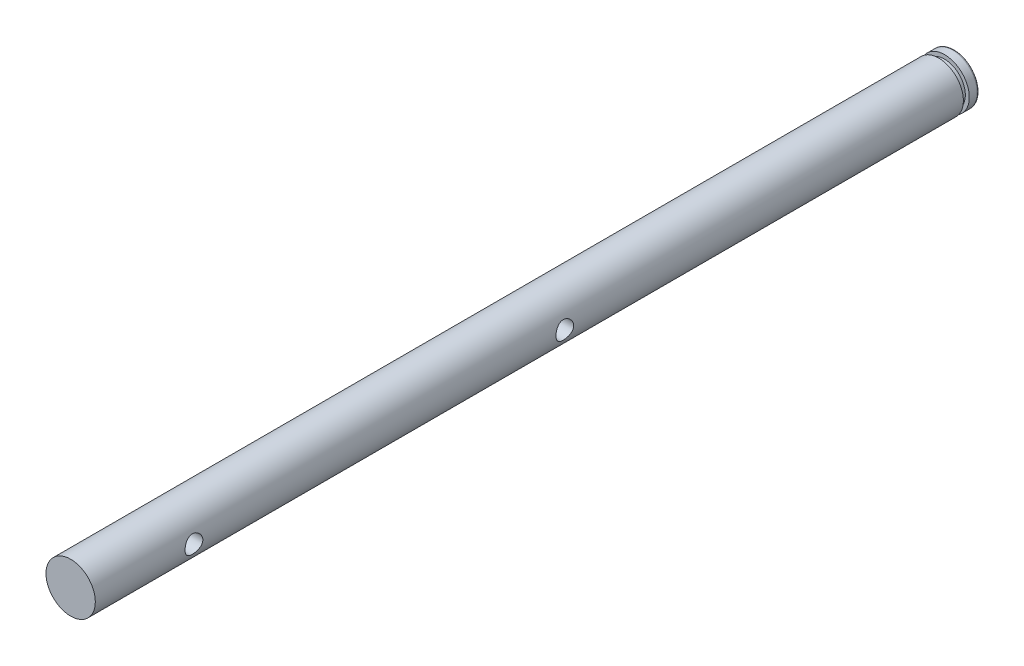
ISO-10303-21;
HEADER;
FILE_DESCRIPTION(('STEP AP214'),'2;1');
FILE_NAME('part.step','',(''),(''),'','','');
FILE_SCHEMA(('AUTOMOTIVE_DESIGN { 1 0 10303 214 1 1 1 1 }'));
ENDSEC;
DATA;
#1=APPLICATION_CONTEXT('core data for automotive mechanical design processes');
#2=APPLICATION_PROTOCOL_DEFINITION('international standard','automotive_design',2000,#1);
#3=PRODUCT_CONTEXT('',#1,'mechanical');
#4=PRODUCT('Part','Part','',(#3));
#5=PRODUCT_RELATED_PRODUCT_CATEGORY('part','',(#4));
#6=PRODUCT_DEFINITION_FORMATION('','',#4);
#7=PRODUCT_DEFINITION_CONTEXT('part definition',#1,'design');
#8=PRODUCT_DEFINITION('design','',#6,#7);
#9=PRODUCT_DEFINITION_SHAPE('','',#8);
#10=(LENGTH_UNIT() NAMED_UNIT(*) SI_UNIT(.MILLI.,.METRE.));
#11=(NAMED_UNIT(*) PLANE_ANGLE_UNIT() SI_UNIT($,.RADIAN.));
#12=(NAMED_UNIT(*) SI_UNIT($,.STERADIAN.) SOLID_ANGLE_UNIT());
#13=UNCERTAINTY_MEASURE_WITH_UNIT(LENGTH_MEASURE(1.E-05),#10,'distance_accuracy_value','');
#14=(GEOMETRIC_REPRESENTATION_CONTEXT(3) GLOBAL_UNCERTAINTY_ASSIGNED_CONTEXT((#13)) GLOBAL_UNIT_ASSIGNED_CONTEXT((#10,
#11,#12)) REPRESENTATION_CONTEXT('',''));
#15=CARTESIAN_POINT('',(0.,0.,0.));
#16=DIRECTION('',(0.,0.,1.));
#17=DIRECTION('',(1.,0.,0.));
#18=AXIS2_PLACEMENT_3D('',#15,#16,#17);
#19=CARTESIAN_POINT('',(0.,0.,113.792));
#20=DIRECTION('',(0.,0.,-1.));
#21=DIRECTION('',(-1.,0.,0.));
#22=AXIS2_PLACEMENT_3D('',#19,#20,#21);
#23=CYLINDRICAL_SURFACE('',#22,3.175);
#24=CARTESIAN_POINT('',(0.,0.,2.032));
#25=DIRECTION('',(0.,0.,-1.));
#26=DIRECTION('',(-1.,0.,0.));
#27=AXIS2_PLACEMENT_3D('',#24,#25,#26);
#28=CIRCLE('',#27,3.175);
#29=CARTESIAN_POINT('',(-3.175,0.,2.032));
#30=VERTEX_POINT('',#29);
#31=EDGE_CURVE('E123',#30,#30,#28,.T.);
#32=ORIENTED_EDGE('',*,*,#31,.F.);
#33=EDGE_LOOP('',(#32));
#34=FACE_BOUND('',#33,.T.);
#35=CARTESIAN_POINT('',(0.,0.,113.792));
#36=DIRECTION('',(0.,0.,1.));
#37=DIRECTION('',(1.,0.,0.));
#38=AXIS2_PLACEMENT_3D('',#35,#36,#37);
#39=CIRCLE('',#38,3.175);
#40=CARTESIAN_POINT('',(3.175,0.,113.792));
#41=VERTEX_POINT('',#40);
#42=EDGE_CURVE('E103',#41,#41,#39,.T.);
#43=ORIENTED_EDGE('',*,*,#42,.F.);
#44=EDGE_LOOP('',(#43));
#45=FACE_BOUND('',#44,.T.);
#46=CARTESIAN_POINT('',(3.175,0.,52.197));
#47=CARTESIAN_POINT('',(3.17500103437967,-0.0620737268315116,52.196998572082));
#48=CARTESIAN_POINT('',(3.17316341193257,-0.124137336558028,52.2020726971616));
#49=CARTESIAN_POINT('',(3.16601537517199,-0.246419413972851,52.222160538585));
#50=CARTESIAN_POINT('',(3.16070515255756,-0.306637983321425,52.2371737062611));
#51=CARTESIAN_POINT('',(3.14718455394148,-0.423449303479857,52.2765464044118));
#52=CARTESIAN_POINT('',(3.1389795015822,-0.480048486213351,52.3008887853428));
#53=CARTESIAN_POINT('',(3.12049390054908,-0.588358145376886,52.3581452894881));
#54=CARTESIAN_POINT('',(3.11021284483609,-0.64006742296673,52.3910615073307));
#55=CARTESIAN_POINT('',(3.08818914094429,-0.739177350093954,52.4658958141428));
#56=CARTESIAN_POINT('',(3.07640741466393,-0.786358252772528,52.5080933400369));
#57=CARTESIAN_POINT('',(3.05291072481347,-0.873147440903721,52.5996990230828));
#58=CARTESIAN_POINT('',(3.04119578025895,-0.912753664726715,52.6491091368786));
#59=CARTESIAN_POINT('',(3.01871377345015,-0.984612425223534,52.7558212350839));
#60=CARTESIAN_POINT('',(3.00799340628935,-1.0165638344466,52.8133368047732));
#61=CARTESIAN_POINT('',(2.98931724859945,-1.07024351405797,52.9333727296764));
#62=CARTESIAN_POINT('',(2.9813604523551,-1.09197550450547,52.9958912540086));
#63=CARTESIAN_POINT('',(2.96952774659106,-1.12374781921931,53.1216386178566));
#64=CARTESIAN_POINT('',(2.96550691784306,-1.13420490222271,53.1847480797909));
#65=CARTESIAN_POINT('',(2.96157547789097,-1.14443378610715,53.3119441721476));
#66=CARTESIAN_POINT('',(2.96166333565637,-1.14420956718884,53.3760304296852));
#67=CARTESIAN_POINT('',(2.96581362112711,-1.13340268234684,53.4996482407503));
#68=CARTESIAN_POINT('',(2.96965932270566,-1.12338482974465,53.55923776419));
#69=CARTESIAN_POINT('',(2.98053386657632,-1.09420418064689,53.6758252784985));
#70=CARTESIAN_POINT('',(2.98756315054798,-1.07504011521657,53.7328229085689));
#71=CARTESIAN_POINT('',(3.00415202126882,-1.02777926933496,53.8438084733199));
#72=CARTESIAN_POINT('',(3.01375474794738,-0.999528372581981,53.8977240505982));
#73=CARTESIAN_POINT('',(3.0343927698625,-0.935002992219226,54.0002186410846));
#74=CARTESIAN_POINT('',(3.04542853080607,-0.89872589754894,54.0487959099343));
#75=CARTESIAN_POINT('',(3.0685184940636,-0.816546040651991,54.1423797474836));
#76=CARTESIAN_POINT('',(3.08059357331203,-0.770188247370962,54.1869825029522));
#77=CARTESIAN_POINT('',(3.10381389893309,-0.67050749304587,54.2678954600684));
#78=CARTESIAN_POINT('',(3.11495902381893,-0.617183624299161,54.3042045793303));
#79=CARTESIAN_POINT('',(3.13525535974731,-0.504119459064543,54.3678988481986));
#80=CARTESIAN_POINT('',(3.14437819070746,-0.444303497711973,54.395159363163));
#81=CARTESIAN_POINT('',(3.15939343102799,-0.320525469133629,54.4390998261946));
#82=CARTESIAN_POINT('',(3.16528715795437,-0.256565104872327,54.4557840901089));
#83=CARTESIAN_POINT('',(3.17295346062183,-0.12971995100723,54.4773449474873));
#84=CARTESIAN_POINT('',(3.17491588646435,-0.0669390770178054,54.4827659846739));
#85=CARTESIAN_POINT('',(3.17507871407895,0.0586581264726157,54.4832190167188));
#86=CARTESIAN_POINT('',(3.17327987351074,0.121474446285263,54.4782531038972));
#87=CARTESIAN_POINT('',(3.16624774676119,0.243071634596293,54.4584938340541));
#88=CARTESIAN_POINT('',(3.16113624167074,0.301916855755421,54.4440487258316));
#89=CARTESIAN_POINT('',(3.14811445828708,0.416314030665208,54.4061909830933));
#90=CARTESIAN_POINT('',(3.14020381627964,0.471865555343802,54.3827771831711));
#91=CARTESIAN_POINT('',(3.12209356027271,0.579863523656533,54.3269185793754));
#92=CARTESIAN_POINT('',(3.11183529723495,0.632176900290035,54.2942360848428));
#93=CARTESIAN_POINT('',(3.09017588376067,0.730745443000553,54.2210401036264));
#94=CARTESIAN_POINT('',(3.07877433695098,0.776998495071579,54.1805238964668));
#95=CARTESIAN_POINT('',(3.05533502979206,0.864710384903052,54.0902616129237));
#96=CARTESIAN_POINT('',(3.04329578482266,0.905781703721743,54.0401383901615));
#97=CARTESIAN_POINT('',(3.02054065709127,0.978996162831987,53.9334644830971));
#98=CARTESIAN_POINT('',(3.00982484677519,1.01113881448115,53.8769134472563));
#99=CARTESIAN_POINT('',(2.99100147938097,1.06553723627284,53.7587081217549));
#100=CARTESIAN_POINT('',(2.98289789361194,1.08777797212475,53.6970462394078));
#101=CARTESIAN_POINT('',(2.97041175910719,1.12143097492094,53.5704840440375));
#102=CARTESIAN_POINT('',(2.96602715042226,1.13284923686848,53.5055855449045));
#103=CARTESIAN_POINT('',(2.96173482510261,1.14402104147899,53.3785536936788));
#104=CARTESIAN_POINT('',(2.96157606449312,1.14442871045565,53.3164858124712));
#105=CARTESIAN_POINT('',(2.96511823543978,1.13521921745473,53.1932164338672));
#106=CARTESIAN_POINT('',(2.96881885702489,1.12560286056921,53.1320148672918));
#107=CARTESIAN_POINT('',(2.97946165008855,1.09711156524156,53.0138138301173));
#108=CARTESIAN_POINT('',(2.98631739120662,1.07848285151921,52.956746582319));
#109=CARTESIAN_POINT('',(3.00245409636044,1.0327054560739,52.846509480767));
#110=CARTESIAN_POINT('',(3.01173564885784,1.00555470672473,52.7933405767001));
#111=CARTESIAN_POINT('',(3.03224829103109,0.941946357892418,52.6895611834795));
#112=CARTESIAN_POINT('',(3.04355296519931,0.905095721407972,52.6392062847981));
#113=CARTESIAN_POINT('',(3.06656563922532,0.82376246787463,52.5451850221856));
#114=CARTESIAN_POINT('',(3.07827376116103,0.779277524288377,52.5015207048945));
#115=CARTESIAN_POINT('',(3.10145286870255,0.681367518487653,52.4199796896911));
#116=CARTESIAN_POINT('',(3.11288513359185,0.627614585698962,52.3824840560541));
#117=CARTESIAN_POINT('',(3.13361916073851,0.514175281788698,52.3170836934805));
#118=CARTESIAN_POINT('',(3.14292103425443,0.454489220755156,52.289178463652));
#119=CARTESIAN_POINT('',(3.15841103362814,0.330185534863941,52.243711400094));
#120=CARTESIAN_POINT('',(3.16456606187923,0.265523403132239,52.2262591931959));
#121=CARTESIAN_POINT('',(3.17285917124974,0.133902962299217,52.2029066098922));
#122=CARTESIAN_POINT('',(3.17499888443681,0.0669455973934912,52.1970015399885));
#123=CARTESIAN_POINT('',(3.175,0.,52.197));
#124=B_SPLINE_CURVE_WITH_KNOTS('',3,(#46,#47,#48,#49,#50,#51,#52,#53,#54,#55,#56,#57,#58,#59,
#60,#61,#62,#63,#64,#65,#66,#67,#68,#69,#70,#71,#72,#73,#74,#75,#76,#77,#78,#79,#80,#81,#82,#83,
#84,#85,#86,#87,#88,#89,#90,#91,#92,#93,#94,#95,#96,#97,#98,#99,#100,#101,#102,#103,#104,#105,
#106,#107,#108,#109,#110,#111,#112,#113,#114,#115,#116,#117,#118,#119,#120,#121,#122,#123),
.UNSPECIFIED.,.T.,.F.,(4,2,2,2,2,2,2,2,2,2,2,2,2,2,2,2,2,2,2,2,2,2,2,2,2,2,2,2,2,2,2,2,2,2,2,2,
2,2,4),(0.,0.185974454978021,0.371938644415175,0.557562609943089,0.743231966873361,
0.935530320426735,1.12788093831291,1.3268730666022,1.52579270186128,1.71707692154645,
1.90828986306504,2.08908884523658,2.26991291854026,2.45398166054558,2.63811037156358,
2.83357232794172,3.02905977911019,3.22713778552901,3.42513491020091,3.61331470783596,
3.801456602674,3.98304672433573,4.16466045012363,4.35143424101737,4.53827301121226,
4.73508157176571,4.93190090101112,5.12901805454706,5.32602595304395,5.51130234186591,
5.69656385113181,5.87702752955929,6.05753502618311,6.24694695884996,6.43641671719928,
6.63503139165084,6.83363569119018,7.03428796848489,7.2348586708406),.UNSPECIFIED.);
#125=CARTESIAN_POINT('',(3.175,0.,52.197));
#126=VERTEX_POINT('',#125);
#127=EDGE_CURVE('E86',#126,#126,#124,.T.);
#128=ORIENTED_EDGE('',*,*,#127,.T.);
#129=EDGE_LOOP('',(#128));
#130=FACE_BOUND('',#129,.T.);
#131=CARTESIAN_POINT('',(-3.175,0.,54.483));
#132=CARTESIAN_POINT('',(-3.17500103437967,-0.062073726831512,54.483001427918));
#133=CARTESIAN_POINT('',(-3.17316341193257,-0.124137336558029,54.4779273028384));
#134=CARTESIAN_POINT('',(-3.16601537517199,-0.246419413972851,54.457839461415));
#135=CARTESIAN_POINT('',(-3.16070515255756,-0.306637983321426,54.4428262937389));
#136=CARTESIAN_POINT('',(-3.14718455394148,-0.423449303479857,54.4034535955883));
#137=CARTESIAN_POINT('',(-3.1389795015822,-0.480048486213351,54.3791112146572));
#138=CARTESIAN_POINT('',(-3.12049390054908,-0.588358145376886,54.3218547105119));
#139=CARTESIAN_POINT('',(-3.11021284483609,-0.64006742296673,54.2889384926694));
#140=CARTESIAN_POINT('',(-3.08818914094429,-0.739177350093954,54.2141041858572));
#141=CARTESIAN_POINT('',(-3.07640741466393,-0.786358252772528,54.1719066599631));
#142=CARTESIAN_POINT('',(-3.05291072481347,-0.873147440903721,54.0803009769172));
#143=CARTESIAN_POINT('',(-3.04119578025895,-0.912753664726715,54.0308908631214));
#144=CARTESIAN_POINT('',(-3.01871377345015,-0.984612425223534,53.9241787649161));
#145=CARTESIAN_POINT('',(-3.00799340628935,-1.0165638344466,53.8666631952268));
#146=CARTESIAN_POINT('',(-2.98931724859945,-1.07024351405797,53.7466272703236));
#147=CARTESIAN_POINT('',(-2.9813604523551,-1.09197550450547,53.6841087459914));
#148=CARTESIAN_POINT('',(-2.96952774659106,-1.12374781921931,53.5583613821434));
#149=CARTESIAN_POINT('',(-2.96550691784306,-1.13420490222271,53.4952519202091));
#150=CARTESIAN_POINT('',(-2.96157547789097,-1.14443378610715,53.3680558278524));
#151=CARTESIAN_POINT('',(-2.96166333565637,-1.14420956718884,53.3039695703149));
#152=CARTESIAN_POINT('',(-2.96581362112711,-1.13340268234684,53.1803517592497));
#153=CARTESIAN_POINT('',(-2.96965932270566,-1.12338482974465,53.1207622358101));
#154=CARTESIAN_POINT('',(-2.98053386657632,-1.0942041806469,53.0041747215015));
#155=CARTESIAN_POINT('',(-2.98756315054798,-1.07504011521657,52.9471770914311));
#156=CARTESIAN_POINT('',(-3.00415202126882,-1.02777926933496,52.8361915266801));
#157=CARTESIAN_POINT('',(-3.01375474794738,-0.999528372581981,52.7822759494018));
#158=CARTESIAN_POINT('',(-3.0343927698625,-0.935002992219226,52.6797813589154));
#159=CARTESIAN_POINT('',(-3.04542853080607,-0.89872589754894,52.6312040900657));
#160=CARTESIAN_POINT('',(-3.0685184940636,-0.816546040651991,52.5376202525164));
#161=CARTESIAN_POINT('',(-3.08059357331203,-0.770188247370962,52.4930174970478));
#162=CARTESIAN_POINT('',(-3.10381389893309,-0.67050749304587,52.4121045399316));
#163=CARTESIAN_POINT('',(-3.11495902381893,-0.617183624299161,52.3757954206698));
#164=CARTESIAN_POINT('',(-3.13525535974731,-0.504119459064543,52.3121011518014));
#165=CARTESIAN_POINT('',(-3.14437819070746,-0.444303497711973,52.284840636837));
#166=CARTESIAN_POINT('',(-3.15939343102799,-0.320525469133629,52.2409001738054));
#167=CARTESIAN_POINT('',(-3.16528715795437,-0.256565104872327,52.2242159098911));
#168=CARTESIAN_POINT('',(-3.17295346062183,-0.12971995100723,52.2026550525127));
#169=CARTESIAN_POINT('',(-3.17491588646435,-0.0669390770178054,52.1972340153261));
#170=CARTESIAN_POINT('',(-3.17507871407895,0.0586581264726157,52.1967809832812));
#171=CARTESIAN_POINT('',(-3.17327987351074,0.121474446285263,52.2017468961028));
#172=CARTESIAN_POINT('',(-3.16624774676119,0.243071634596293,52.2215061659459));
#173=CARTESIAN_POINT('',(-3.16113624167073,0.301916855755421,52.2359512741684));
#174=CARTESIAN_POINT('',(-3.14811445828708,0.416314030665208,52.2738090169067));
#175=CARTESIAN_POINT('',(-3.14020381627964,0.471865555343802,52.2972228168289));
#176=CARTESIAN_POINT('',(-3.12209356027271,0.579863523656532,52.3530814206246));
#177=CARTESIAN_POINT('',(-3.11183529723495,0.632176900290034,52.3857639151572));
#178=CARTESIAN_POINT('',(-3.09017588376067,0.730745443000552,52.4589598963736));
#179=CARTESIAN_POINT('',(-3.07877433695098,0.776998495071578,52.4994761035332));
#180=CARTESIAN_POINT('',(-3.05533502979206,0.864710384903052,52.5897383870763));
#181=CARTESIAN_POINT('',(-3.04329578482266,0.905781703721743,52.6398616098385));
#182=CARTESIAN_POINT('',(-3.02054065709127,0.978996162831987,52.7465355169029));
#183=CARTESIAN_POINT('',(-3.00982484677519,1.01113881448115,52.8030865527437));
#184=CARTESIAN_POINT('',(-2.99100147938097,1.06553723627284,52.9212918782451));
#185=CARTESIAN_POINT('',(-2.98289789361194,1.08777797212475,52.9829537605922));
#186=CARTESIAN_POINT('',(-2.97041175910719,1.12143097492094,53.1095159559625));
#187=CARTESIAN_POINT('',(-2.96602715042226,1.13284923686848,53.1744144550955));
#188=CARTESIAN_POINT('',(-2.96173482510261,1.14402104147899,53.3014463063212));
#189=CARTESIAN_POINT('',(-2.96157606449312,1.14442871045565,53.3635141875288));
#190=CARTESIAN_POINT('',(-2.96511823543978,1.13521921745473,53.4867835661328));
#191=CARTESIAN_POINT('',(-2.96881885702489,1.12560286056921,53.5479851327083));
#192=CARTESIAN_POINT('',(-2.97946165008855,1.09711156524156,53.6661861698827));
#193=CARTESIAN_POINT('',(-2.98631739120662,1.07848285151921,53.7232534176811));
#194=CARTESIAN_POINT('',(-3.00245409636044,1.0327054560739,53.833490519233));
#195=CARTESIAN_POINT('',(-3.01173564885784,1.00555470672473,53.8866594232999));
#196=CARTESIAN_POINT('',(-3.03224829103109,0.941946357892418,53.9904388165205));
#197=CARTESIAN_POINT('',(-3.04355296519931,0.905095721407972,54.0407937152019));
#198=CARTESIAN_POINT('',(-3.06656563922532,0.82376246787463,54.1348149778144));
#199=CARTESIAN_POINT('',(-3.07827376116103,0.779277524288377,54.1784792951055));
#200=CARTESIAN_POINT('',(-3.10145286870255,0.681367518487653,54.2600203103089));
#201=CARTESIAN_POINT('',(-3.11288513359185,0.627614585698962,54.2975159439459));
#202=CARTESIAN_POINT('',(-3.13361916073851,0.514175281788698,54.3629163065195));
#203=CARTESIAN_POINT('',(-3.14292103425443,0.454489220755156,54.3908215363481));
#204=CARTESIAN_POINT('',(-3.15841103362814,0.330185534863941,54.436288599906));
#205=CARTESIAN_POINT('',(-3.16456606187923,0.265523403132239,54.4537408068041));
#206=CARTESIAN_POINT('',(-3.17285917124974,0.133902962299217,54.4770933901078));
#207=CARTESIAN_POINT('',(-3.17499888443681,0.0669455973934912,54.4829984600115));
#208=CARTESIAN_POINT('',(-3.175,0.,54.483));
#209=B_SPLINE_CURVE_WITH_KNOTS('',3,(#131,#132,#133,#134,#135,#136,#137,#138,#139,#140,#141,
#142,#143,#144,#145,#146,#147,#148,#149,#150,#151,#152,#153,#154,#155,#156,#157,#158,#159,#160,
#161,#162,#163,#164,#165,#166,#167,#168,#169,#170,#171,#172,#173,#174,#175,#176,#177,#178,#179,
#180,#181,#182,#183,#184,#185,#186,#187,#188,#189,#190,#191,#192,#193,#194,#195,#196,#197,#198,
#199,#200,#201,#202,#203,#204,#205,#206,#207,#208),.UNSPECIFIED.,.T.,.F.,(4,2,2,2,2,2,2,2,2,2,2,
2,2,2,2,2,2,2,2,2,2,2,2,2,2,2,2,2,2,2,2,2,2,2,2,2,2,2,4),(0.,0.185974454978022,
0.371938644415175,0.557562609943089,0.743231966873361,0.935530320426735,1.12788093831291,
1.3268730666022,1.52579270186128,1.71707692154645,1.90828986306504,2.08908884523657,
2.26991291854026,2.45398166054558,2.63811037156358,2.83357232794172,3.02905977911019,
3.22713778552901,3.42513491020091,3.61331470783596,3.801456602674,3.98304672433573,
4.16466045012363,4.35143424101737,4.53827301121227,4.73508157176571,4.93190090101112,
5.12901805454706,5.32602595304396,5.51130234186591,5.69656385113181,5.87702752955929,
6.05753502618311,6.24694695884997,6.43641671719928,6.63503139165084,6.83363569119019,
7.03428796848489,7.2348586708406),.UNSPECIFIED.);
#210=CARTESIAN_POINT('',(-3.175,0.,54.483));
#211=VERTEX_POINT('',#210);
#212=EDGE_CURVE('E91',#211,#211,#209,.T.);
#213=ORIENTED_EDGE('',*,*,#212,.T.);
#214=EDGE_LOOP('',(#213));
#215=FACE_BOUND('',#214,.T.);
#216=CARTESIAN_POINT('',(3.175,0.,99.949));
#217=CARTESIAN_POINT('',(3.17500103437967,-0.0620737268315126,99.948998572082));
#218=CARTESIAN_POINT('',(3.17316341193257,-0.12413733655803,99.9540726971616));
#219=CARTESIAN_POINT('',(3.16601537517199,-0.246419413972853,99.974160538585));
#220=CARTESIAN_POINT('',(3.16070515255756,-0.306637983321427,99.9891737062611));
#221=CARTESIAN_POINT('',(3.14718455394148,-0.42344930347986,100.028546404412));
#222=CARTESIAN_POINT('',(3.1389795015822,-0.480048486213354,100.052888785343));
#223=CARTESIAN_POINT('',(3.12049390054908,-0.588358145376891,100.110145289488));
#224=CARTESIAN_POINT('',(3.11021284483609,-0.640067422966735,100.143061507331));
#225=CARTESIAN_POINT('',(3.08818914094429,-0.739177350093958,100.217895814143));
#226=CARTESIAN_POINT('',(3.07640741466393,-0.786358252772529,100.260093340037));
#227=CARTESIAN_POINT('',(3.05291072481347,-0.87314744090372,100.351699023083));
#228=CARTESIAN_POINT('',(3.04119578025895,-0.912753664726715,100.401109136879));
#229=CARTESIAN_POINT('',(3.01871377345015,-0.984612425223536,100.507821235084));
#230=CARTESIAN_POINT('',(3.00799340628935,-1.01656383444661,100.565336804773));
#231=CARTESIAN_POINT('',(2.98931724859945,-1.07024351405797,100.685372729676));
#232=CARTESIAN_POINT('',(2.9813604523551,-1.09197550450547,100.747891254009));
#233=CARTESIAN_POINT('',(2.96952774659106,-1.12374781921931,100.873638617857));
#234=CARTESIAN_POINT('',(2.96550691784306,-1.13420490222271,100.936748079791));
#235=CARTESIAN_POINT('',(2.96157547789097,-1.14443378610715,101.063944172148));
#236=CARTESIAN_POINT('',(2.96166333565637,-1.14420956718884,101.128030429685));
#237=CARTESIAN_POINT('',(2.96581362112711,-1.13340268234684,101.25164824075));
#238=CARTESIAN_POINT('',(2.96965932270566,-1.12338482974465,101.31123776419));
#239=CARTESIAN_POINT('',(2.98053386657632,-1.0942041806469,101.427825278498));
#240=CARTESIAN_POINT('',(2.98756315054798,-1.07504011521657,101.484822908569));
#241=CARTESIAN_POINT('',(3.00415202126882,-1.02777926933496,101.59580847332));
#242=CARTESIAN_POINT('',(3.01375474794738,-0.999528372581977,101.649724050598));
#243=CARTESIAN_POINT('',(3.0343927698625,-0.935002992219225,101.752218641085));
#244=CARTESIAN_POINT('',(3.04542853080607,-0.898725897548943,101.800795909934));
#245=CARTESIAN_POINT('',(3.0685184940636,-0.816546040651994,101.894379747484));
#246=CARTESIAN_POINT('',(3.08059357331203,-0.770188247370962,101.938982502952));
#247=CARTESIAN_POINT('',(3.10381389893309,-0.670507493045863,102.019895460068));
#248=CARTESIAN_POINT('',(3.11495902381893,-0.617183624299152,102.05620457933));
#249=CARTESIAN_POINT('',(3.13525535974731,-0.504119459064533,102.119898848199));
#250=CARTESIAN_POINT('',(3.14437819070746,-0.444303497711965,102.147159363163));
#251=CARTESIAN_POINT('',(3.15939343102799,-0.320525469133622,102.191099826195));
#252=CARTESIAN_POINT('',(3.16528715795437,-0.256565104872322,102.207784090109));
#253=CARTESIAN_POINT('',(3.17295346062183,-0.129719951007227,102.229344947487));
#254=CARTESIAN_POINT('',(3.17491588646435,-0.0669390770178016,102.234765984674));
#255=CARTESIAN_POINT('',(3.17507871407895,0.0586581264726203,102.235219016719));
#256=CARTESIAN_POINT('',(3.17327987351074,0.121474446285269,102.230253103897));
#257=CARTESIAN_POINT('',(3.16624774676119,0.243071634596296,102.210493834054));
#258=CARTESIAN_POINT('',(3.16113624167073,0.301916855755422,102.196048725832));
#259=CARTESIAN_POINT('',(3.14811445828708,0.41631403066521,102.158190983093));
#260=CARTESIAN_POINT('',(3.14020381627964,0.471865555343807,102.134777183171));
#261=CARTESIAN_POINT('',(3.1220935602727,0.579863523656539,102.078918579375));
#262=CARTESIAN_POINT('',(3.11183529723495,0.63217690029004,102.046236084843));
#263=CARTESIAN_POINT('',(3.09017588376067,0.730745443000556,101.973040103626));
#264=CARTESIAN_POINT('',(3.07877433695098,0.776998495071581,101.932523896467));
#265=CARTESIAN_POINT('',(3.05533502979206,0.864710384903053,101.842261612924));
#266=CARTESIAN_POINT('',(3.04329578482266,0.905781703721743,101.792138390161));
#267=CARTESIAN_POINT('',(3.02054065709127,0.978996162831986,101.685464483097));
#268=CARTESIAN_POINT('',(3.00982484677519,1.01113881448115,101.628913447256));
#269=CARTESIAN_POINT('',(2.99100147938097,1.06553723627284,101.510708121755));
#270=CARTESIAN_POINT('',(2.98289789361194,1.08777797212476,101.449046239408));
#271=CARTESIAN_POINT('',(2.97041175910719,1.12143097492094,101.322484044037));
#272=CARTESIAN_POINT('',(2.96602715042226,1.13284923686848,101.257585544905));
#273=CARTESIAN_POINT('',(2.96173482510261,1.14402104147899,101.130553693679));
#274=CARTESIAN_POINT('',(2.96157606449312,1.14442871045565,101.068485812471));
#275=CARTESIAN_POINT('',(2.96511823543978,1.13521921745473,100.945216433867));
#276=CARTESIAN_POINT('',(2.9688188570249,1.1256028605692,100.884014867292));
#277=CARTESIAN_POINT('',(2.97946165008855,1.09711156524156,100.765813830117));
#278=CARTESIAN_POINT('',(2.98631739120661,1.07848285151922,100.708746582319));
#279=CARTESIAN_POINT('',(3.00245409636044,1.03270545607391,100.598509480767));
#280=CARTESIAN_POINT('',(3.01173564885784,1.00555470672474,100.5453405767));
#281=CARTESIAN_POINT('',(3.03224829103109,0.941946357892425,100.44156118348));
#282=CARTESIAN_POINT('',(3.04355296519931,0.905095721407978,100.391206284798));
#283=CARTESIAN_POINT('',(3.06656563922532,0.823762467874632,100.297185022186));
#284=CARTESIAN_POINT('',(3.07827376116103,0.779277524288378,100.253520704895));
#285=CARTESIAN_POINT('',(3.10145286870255,0.681367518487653,100.171979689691));
#286=CARTESIAN_POINT('',(3.11288513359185,0.627614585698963,100.134484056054));
#287=CARTESIAN_POINT('',(3.13361916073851,0.514175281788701,100.069083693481));
#288=CARTESIAN_POINT('',(3.14292103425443,0.454489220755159,100.041178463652));
#289=CARTESIAN_POINT('',(3.15841103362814,0.330185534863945,99.995711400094));
#290=CARTESIAN_POINT('',(3.16456606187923,0.265523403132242,99.9782591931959));
#291=CARTESIAN_POINT('',(3.17285917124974,0.133902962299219,99.9549066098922));
#292=CARTESIAN_POINT('',(3.17499888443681,0.0669455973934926,99.9490015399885));
#293=CARTESIAN_POINT('',(3.175,0.,99.949));
#294=B_SPLINE_CURVE_WITH_KNOTS('',3,(#216,#217,#218,#219,#220,#221,#222,#223,#224,#225,#226,
#227,#228,#229,#230,#231,#232,#233,#234,#235,#236,#237,#238,#239,#240,#241,#242,#243,#244,#245,
#246,#247,#248,#249,#250,#251,#252,#253,#254,#255,#256,#257,#258,#259,#260,#261,#262,#263,#264,
#265,#266,#267,#268,#269,#270,#271,#272,#273,#274,#275,#276,#277,#278,#279,#280,#281,#282,#283,
#284,#285,#286,#287,#288,#289,#290,#291,#292,#293),.UNSPECIFIED.,.T.,.F.,(4,2,2,2,2,2,2,2,2,2,2,
2,2,2,2,2,2,2,2,2,2,2,2,2,2,2,2,2,2,2,2,2,2,2,2,2,2,2,4),(0.,0.185974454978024,
0.371938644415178,0.557562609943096,0.743231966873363,0.935530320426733,1.12788093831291,
1.3268730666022,1.52579270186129,1.71707692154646,1.90828986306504,2.08908884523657,
2.26991291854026,2.45398166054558,2.63811037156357,2.83357232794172,3.02905977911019,
3.22713778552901,3.42513491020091,3.61331470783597,3.801456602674,3.98304672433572,
4.16466045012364,4.35143424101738,4.53827301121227,4.7350815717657,4.93190090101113,
5.12901805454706,5.32602595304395,5.51130234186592,5.6965638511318,5.87702752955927,
6.05753502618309,6.24694695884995,6.43641671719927,6.63503139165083,6.83363569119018,
7.03428796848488,7.23485867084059),.UNSPECIFIED.);
#295=CARTESIAN_POINT('',(3.175,0.,99.949));
#296=VERTEX_POINT('',#295);
#297=EDGE_CURVE('E55',#296,#296,#294,.T.);
#298=ORIENTED_EDGE('',*,*,#297,.T.);
#299=EDGE_LOOP('',(#298));
#300=FACE_BOUND('',#299,.T.);
#301=CARTESIAN_POINT('',(-3.175,0.,102.235));
#302=CARTESIAN_POINT('',(-3.17500103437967,-0.0620737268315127,102.235001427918));
#303=CARTESIAN_POINT('',(-3.17316341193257,-0.12413733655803,102.229927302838));
#304=CARTESIAN_POINT('',(-3.16601537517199,-0.246419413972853,102.209839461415));
#305=CARTESIAN_POINT('',(-3.16070515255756,-0.306637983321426,102.194826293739));
#306=CARTESIAN_POINT('',(-3.14718455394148,-0.423449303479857,102.155453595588));
#307=CARTESIAN_POINT('',(-3.1389795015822,-0.480048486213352,102.131111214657));
#308=CARTESIAN_POINT('',(-3.12049390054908,-0.588358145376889,102.073854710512));
#309=CARTESIAN_POINT('',(-3.11021284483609,-0.640067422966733,102.040938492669));
#310=CARTESIAN_POINT('',(-3.08818914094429,-0.739177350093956,101.966104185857));
#311=CARTESIAN_POINT('',(-3.07640741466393,-0.786358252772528,101.923906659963));
#312=CARTESIAN_POINT('',(-3.05291072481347,-0.87314744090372,101.832300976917));
#313=CARTESIAN_POINT('',(-3.04119578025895,-0.912753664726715,101.782890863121));
#314=CARTESIAN_POINT('',(-3.01871377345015,-0.984612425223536,101.676178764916));
#315=CARTESIAN_POINT('',(-3.00799340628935,-1.01656383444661,101.618663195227));
#316=CARTESIAN_POINT('',(-2.98931724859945,-1.07024351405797,101.498627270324));
#317=CARTESIAN_POINT('',(-2.9813604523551,-1.09197550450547,101.436108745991));
#318=CARTESIAN_POINT('',(-2.96952774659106,-1.12374781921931,101.310361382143));
#319=CARTESIAN_POINT('',(-2.96550691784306,-1.13420490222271,101.247251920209));
#320=CARTESIAN_POINT('',(-2.96157547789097,-1.14443378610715,101.120055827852));
#321=CARTESIAN_POINT('',(-2.96166333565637,-1.14420956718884,101.055969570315));
#322=CARTESIAN_POINT('',(-2.96581362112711,-1.13340268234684,100.93235175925));
#323=CARTESIAN_POINT('',(-2.96965932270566,-1.12338482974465,100.87276223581));
#324=CARTESIAN_POINT('',(-2.98053386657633,-1.09420418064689,100.756174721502));
#325=CARTESIAN_POINT('',(-2.98756315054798,-1.07504011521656,100.699177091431));
#326=CARTESIAN_POINT('',(-3.00415202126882,-1.02777926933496,100.58819152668));
#327=CARTESIAN_POINT('',(-3.01375474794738,-0.999528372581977,100.534275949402));
#328=CARTESIAN_POINT('',(-3.0343927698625,-0.935002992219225,100.431781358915));
#329=CARTESIAN_POINT('',(-3.04542853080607,-0.898725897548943,100.383204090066));
#330=CARTESIAN_POINT('',(-3.0685184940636,-0.816546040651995,100.289620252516));
#331=CARTESIAN_POINT('',(-3.08059357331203,-0.770188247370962,100.245017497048));
#332=CARTESIAN_POINT('',(-3.10381389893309,-0.670507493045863,100.164104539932));
#333=CARTESIAN_POINT('',(-3.11495902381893,-0.617183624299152,100.12779542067));
#334=CARTESIAN_POINT('',(-3.13525535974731,-0.504119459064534,100.064101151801));
#335=CARTESIAN_POINT('',(-3.14437819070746,-0.444303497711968,100.036840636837));
#336=CARTESIAN_POINT('',(-3.15939343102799,-0.320525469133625,99.9929001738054));
#337=CARTESIAN_POINT('',(-3.16528715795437,-0.256565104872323,99.9762159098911));
#338=CARTESIAN_POINT('',(-3.17295346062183,-0.129719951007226,99.9546550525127));
#339=CARTESIAN_POINT('',(-3.17491588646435,-0.0669390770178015,99.9492340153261));
#340=CARTESIAN_POINT('',(-3.17507871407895,0.0586581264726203,99.9487809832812));
#341=CARTESIAN_POINT('',(-3.17327987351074,0.121474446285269,99.9537468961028));
#342=CARTESIAN_POINT('',(-3.16624774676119,0.243071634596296,99.9735061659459));
#343=CARTESIAN_POINT('',(-3.16113624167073,0.301916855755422,99.9879512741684));
#344=CARTESIAN_POINT('',(-3.14811445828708,0.41631403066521,100.025809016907));
#345=CARTESIAN_POINT('',(-3.14020381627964,0.471865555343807,100.049222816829));
#346=CARTESIAN_POINT('',(-3.1220935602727,0.579863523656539,100.105081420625));
#347=CARTESIAN_POINT('',(-3.11183529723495,0.63217690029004,100.137763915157));
#348=CARTESIAN_POINT('',(-3.09017588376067,0.730745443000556,100.210959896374));
#349=CARTESIAN_POINT('',(-3.07877433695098,0.776998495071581,100.251476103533));
#350=CARTESIAN_POINT('',(-3.05533502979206,0.864710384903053,100.341738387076));
#351=CARTESIAN_POINT('',(-3.04329578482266,0.905781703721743,100.391861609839));
#352=CARTESIAN_POINT('',(-3.02054065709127,0.978996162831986,100.498535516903));
#353=CARTESIAN_POINT('',(-3.00982484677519,1.01113881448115,100.555086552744));
#354=CARTESIAN_POINT('',(-2.99100147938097,1.06553723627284,100.673291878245));
#355=CARTESIAN_POINT('',(-2.98289789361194,1.08777797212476,100.734953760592));
#356=CARTESIAN_POINT('',(-2.97041175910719,1.12143097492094,100.861515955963));
#357=CARTESIAN_POINT('',(-2.96602715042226,1.13284923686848,100.926414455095));
#358=CARTESIAN_POINT('',(-2.96173482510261,1.14402104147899,101.053446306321));
#359=CARTESIAN_POINT('',(-2.96157606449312,1.14442871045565,101.115514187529));
#360=CARTESIAN_POINT('',(-2.96511823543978,1.13521921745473,101.238783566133));
#361=CARTESIAN_POINT('',(-2.9688188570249,1.1256028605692,101.299985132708));
#362=CARTESIAN_POINT('',(-2.97946165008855,1.09711156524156,101.418186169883));
#363=CARTESIAN_POINT('',(-2.98631739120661,1.07848285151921,101.475253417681));
#364=CARTESIAN_POINT('',(-3.00245409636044,1.0327054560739,101.585490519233));
#365=CARTESIAN_POINT('',(-3.01173564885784,1.00555470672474,101.6386594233));
#366=CARTESIAN_POINT('',(-3.03224829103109,0.941946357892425,101.74243881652));
#367=CARTESIAN_POINT('',(-3.04355296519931,0.905095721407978,101.792793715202));
#368=CARTESIAN_POINT('',(-3.06656563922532,0.823762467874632,101.886814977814));
#369=CARTESIAN_POINT('',(-3.07827376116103,0.779277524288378,101.930479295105));
#370=CARTESIAN_POINT('',(-3.10145286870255,0.681367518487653,102.012020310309));
#371=CARTESIAN_POINT('',(-3.11288513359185,0.627614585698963,102.049515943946));
#372=CARTESIAN_POINT('',(-3.13361916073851,0.514175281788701,102.114916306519));
#373=CARTESIAN_POINT('',(-3.14292103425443,0.454489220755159,102.142821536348));
#374=CARTESIAN_POINT('',(-3.15841103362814,0.330185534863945,102.188288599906));
#375=CARTESIAN_POINT('',(-3.16456606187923,0.265523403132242,102.205740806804));
#376=CARTESIAN_POINT('',(-3.17285917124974,0.133902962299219,102.229093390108));
#377=CARTESIAN_POINT('',(-3.17499888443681,0.0669455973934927,102.234998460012));
#378=CARTESIAN_POINT('',(-3.175,0.,102.235));
#379=B_SPLINE_CURVE_WITH_KNOTS('',3,(#301,#302,#303,#304,#305,#306,#307,#308,#309,#310,#311,
#312,#313,#314,#315,#316,#317,#318,#319,#320,#321,#322,#323,#324,#325,#326,#327,#328,#329,#330,
#331,#332,#333,#334,#335,#336,#337,#338,#339,#340,#341,#342,#343,#344,#345,#346,#347,#348,#349,
#350,#351,#352,#353,#354,#355,#356,#357,#358,#359,#360,#361,#362,#363,#364,#365,#366,#367,#368,
#369,#370,#371,#372,#373,#374,#375,#376,#377,#378),.UNSPECIFIED.,.T.,.F.,(4,2,2,2,2,2,2,2,2,2,2,
2,2,2,2,2,2,2,2,2,2,2,2,2,2,2,2,2,2,2,2,2,2,2,2,2,2,2,4),(0.,0.185974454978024,
0.371938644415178,0.557562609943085,0.743231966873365,0.935530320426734,1.12788093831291,
1.3268730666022,1.52579270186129,1.71707692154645,1.90828986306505,2.08908884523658,
2.26991291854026,2.45398166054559,2.63811037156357,2.83357232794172,3.0290597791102,
3.22713778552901,3.42513491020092,3.61331470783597,3.801456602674,3.98304672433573,
4.16466045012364,4.35143424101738,4.53827301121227,4.7350815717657,4.93190090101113,
5.12901805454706,5.32602595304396,5.51130234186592,5.6965638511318,5.87702752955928,
6.05753502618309,6.24694695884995,6.43641671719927,6.63503139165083,6.83363569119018,
7.03428796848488,7.23485867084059),.UNSPECIFIED.);
#380=CARTESIAN_POINT('',(-3.175,0.,102.235));
#381=VERTEX_POINT('',#380);
#382=EDGE_CURVE('E50',#381,#381,#379,.T.);
#383=ORIENTED_EDGE('',*,*,#382,.T.);
#384=EDGE_LOOP('',(#383));
#385=FACE_BOUND('',#384,.T.);
#386=ADVANCED_FACE('F37',(#34,#45,#130,#215,#300,#385),#23,.T.);
#387=CARTESIAN_POINT('',(0.,0.,113.792));
#388=DIRECTION('',(0.,0.,1.));
#389=DIRECTION('',(1.,0.,0.));
#390=AXIS2_PLACEMENT_3D('',#387,#388,#389);
#391=PLANE('',#390);
#392=ORIENTED_EDGE('',*,*,#42,.T.);
#393=EDGE_LOOP('',(#392));
#394=FACE_BOUND('',#393,.T.);
#395=ADVANCED_FACE('F82',(#394),#391,.T.);
#396=CARTESIAN_POINT('',(-3.175,0.,53.34));
#397=DIRECTION('',(1.,0.,0.));
#398=DIRECTION('',(0.,0.,-1.));
#399=AXIS2_PLACEMENT_3D('',#396,#397,#398);
#400=CYLINDRICAL_SURFACE('',#399,1.143);
#401=ORIENTED_EDGE('',*,*,#127,.F.);
#402=EDGE_LOOP('',(#401));
#403=FACE_BOUND('',#402,.T.);
#404=ORIENTED_EDGE('',*,*,#212,.F.);
#405=EDGE_LOOP('',(#404));
#406=FACE_BOUND('',#405,.T.);
#407=ADVANCED_FACE('F75',(#403,#406),#400,.F.);
#408=CARTESIAN_POINT('',(-3.175,0.,101.092));
#409=DIRECTION('',(1.,0.,0.));
#410=DIRECTION('',(0.,0.,-1.));
#411=AXIS2_PLACEMENT_3D('',#408,#409,#410);
#412=CYLINDRICAL_SURFACE('',#411,1.143);
#413=ORIENTED_EDGE('',*,*,#297,.F.);
#414=EDGE_LOOP('',(#413));
#415=FACE_BOUND('',#414,.T.);
#416=ORIENTED_EDGE('',*,*,#382,.F.);
#417=EDGE_LOOP('',(#416));
#418=FACE_BOUND('',#417,.T.);
#419=ADVANCED_FACE('F69',(#415,#418),#412,.F.);
#420=CARTESIAN_POINT('',(0.,3.175,2.032));
#421=DIRECTION('',(0.,0.,1.));
#422=DIRECTION('',(1.,0.,0.));
#423=AXIS2_PLACEMENT_3D('',#420,#421,#422);
#424=PLANE('',#423);
#425=CARTESIAN_POINT('',(0.,0.,2.032));
#426=DIRECTION('',(0.,0.,-1.));
#427=DIRECTION('',(-1.,0.,0.));
#428=AXIS2_PLACEMENT_3D('',#425,#426,#427);
#429=CIRCLE('',#428,2.667);
#430=CARTESIAN_POINT('',(-2.667,0.,2.032));
#431=VERTEX_POINT('',#430);
#432=EDGE_CURVE('E108',#431,#431,#429,.T.);
#433=ORIENTED_EDGE('',*,*,#432,.F.);
#434=EDGE_LOOP('',(#433));
#435=FACE_BOUND('',#434,.T.);
#436=ORIENTED_EDGE('',*,*,#31,.T.);
#437=EDGE_LOOP('',(#436));
#438=FACE_BOUND('',#437,.T.);
#439=ADVANCED_FACE('F74',(#435,#438),#424,.F.);
#440=CARTESIAN_POINT('',(0.,0.,0.));
#441=DIRECTION('',(0.,0.,-1.));
#442=DIRECTION('',(-1.,0.,0.));
#443=AXIS2_PLACEMENT_3D('',#440,#441,#442);
#444=CYLINDRICAL_SURFACE('',#443,2.667);
#445=CARTESIAN_POINT('',(0.,0.,1.27));
#446=DIRECTION('',(0.,0.,-1.));
#447=DIRECTION('',(-1.,0.,0.));
#448=AXIS2_PLACEMENT_3D('',#445,#446,#447);
#449=CIRCLE('',#448,2.667);
#450=CARTESIAN_POINT('',(-2.667,0.,1.27));
#451=VERTEX_POINT('',#450);
#452=EDGE_CURVE('E113',#451,#451,#449,.T.);
#453=ORIENTED_EDGE('',*,*,#452,.F.);
#454=EDGE_LOOP('',(#453));
#455=FACE_BOUND('',#454,.T.);
#456=ORIENTED_EDGE('',*,*,#432,.T.);
#457=EDGE_LOOP('',(#456));
#458=FACE_BOUND('',#457,.T.);
#459=ADVANCED_FACE('F152',(#455,#458),#444,.T.);
#460=CARTESIAN_POINT('',(0.,3.175,1.27));
#461=DIRECTION('',(0.,0.,-1.));
#462=DIRECTION('',(-1.,0.,0.));
#463=AXIS2_PLACEMENT_3D('',#460,#461,#462);
#464=PLANE('',#463);
#465=CARTESIAN_POINT('',(0.,0.,1.27));
#466=DIRECTION('',(0.,0.,-1.));
#467=DIRECTION('',(-1.,0.,0.));
#468=AXIS2_PLACEMENT_3D('',#465,#466,#467);
#469=CIRCLE('',#468,3.175);
#470=CARTESIAN_POINT('',(-3.175,0.,1.27));
#471=VERTEX_POINT('',#470);
#472=EDGE_CURVE('E119',#471,#471,#469,.T.);
#473=ORIENTED_EDGE('',*,*,#472,.F.);
#474=EDGE_LOOP('',(#473));
#475=FACE_BOUND('',#474,.T.);
#476=ORIENTED_EDGE('',*,*,#452,.T.);
#477=EDGE_LOOP('',(#476));
#478=FACE_BOUND('',#477,.T.);
#479=ADVANCED_FACE('F146',(#475,#478),#464,.F.);
#480=CARTESIAN_POINT('',(0.,0.,0.));
#481=DIRECTION('',(0.,0.,1.));
#482=DIRECTION('',(1.,0.,0.));
#483=AXIS2_PLACEMENT_3D('',#480,#481,#482);
#484=PLANE('',#483);
#485=CARTESIAN_POINT('',(0.,0.,0.));
#486=DIRECTION('',(0.,0.,1.));
#487=DIRECTION('',(1.,0.,0.));
#488=AXIS2_PLACEMENT_3D('',#485,#486,#487);
#489=CIRCLE('',#488,2.921);
#490=CARTESIAN_POINT('',(2.921,0.,0.));
#491=VERTEX_POINT('',#490);
#492=EDGE_CURVE('E10',#491,#491,#489,.F.);
#493=ORIENTED_EDGE('',*,*,#492,.T.);
#494=EDGE_LOOP('',(#493));
#495=FACE_BOUND('',#494,.T.);
#496=ADVANCED_FACE('F140',(#495),#484,.F.);
#497=CARTESIAN_POINT('',(0.,0.,0.254000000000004));
#498=DIRECTION('',(0.,0.,1.));
#499=DIRECTION('',(1.,0.,0.));
#500=AXIS2_PLACEMENT_3D('',#497,#498,#499);
#501=CIRCLE('',#500,3.175);
#502=CARTESIAN_POINT('',(3.175,0.,0.254000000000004));
#503=VERTEX_POINT('',#502);
#504=EDGE_CURVE('E45',#503,#503,#501,.T.);
#505=ORIENTED_EDGE('',*,*,#504,.T.);
#506=EDGE_LOOP('',(#505));
#507=FACE_BOUND('',#506,.T.);
#508=ORIENTED_EDGE('',*,*,#472,.T.);
#509=EDGE_LOOP('',(#508));
#510=FACE_BOUND('',#509,.T.);
#511=ADVANCED_FACE('F66',(#507,#510),#23,.T.);
#512=CARTESIAN_POINT('',(0.,0.,0.254000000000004));
#513=DIRECTION('',(0.,0.,1.));
#514=DIRECTION('',(1.,0.,0.));
#515=AXIS2_PLACEMENT_3D('',#512,#513,#514);
#516=TOROIDAL_SURFACE('',#515,2.921,0.254);
#517=ORIENTED_EDGE('',*,*,#492,.F.);
#518=EDGE_LOOP('',(#517));
#519=FACE_BOUND('',#518,.T.);
#520=ORIENTED_EDGE('',*,*,#504,.F.);
#521=EDGE_LOOP('',(#520));
#522=FACE_BOUND('',#521,.T.);
#523=ADVANCED_FACE('F39',(#519,#522),#516,.T.);
#524=CLOSED_SHELL('',(#386,#395,#407,#419,#439,#459,#479,#496,#511,#523));
#525=MANIFOLD_SOLID_BREP('B2',#524);
#526=ADVANCED_BREP_SHAPE_REPRESENTATION('',(#18,#525),#14);
#527=SHAPE_DEFINITION_REPRESENTATION(#9,#526);
ENDSEC;
END-ISO-10303-21;
